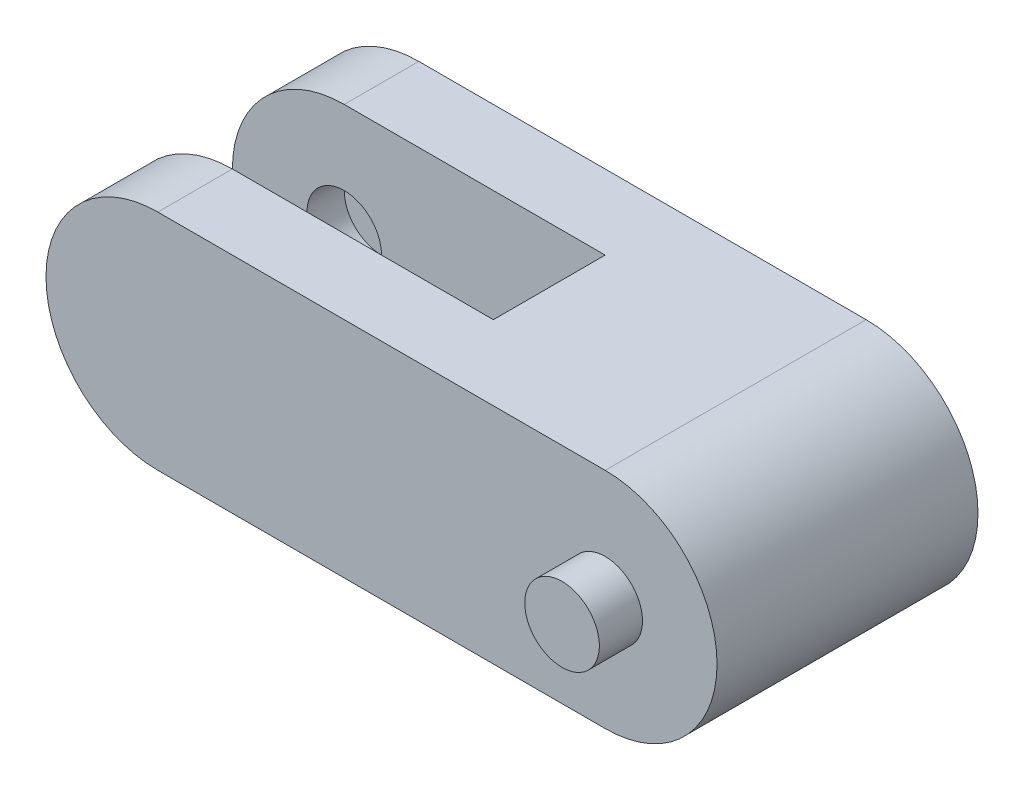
from build123d import *

# Parameters (mm, degrees)
BOSS_EXTRUDE1_DEPTH = 44.45
SKETCH3_R           = 12.7
BOSS_EXTRUDE2_DEPTH = 14.7
CUT_EXTRUDE1_DEPTH  = 19.05
SKETCH7_R           = 12.7
CUT_EXTRUDE2_DEPTH  = 12.7


with BuildPart() as part:
    # Sketch2 → Boss-Extrude1 (new, symmetric)
    with BuildSketch(Plane.XY):
        with BuildLine():
            Line((-76.2, 38.1), (76.2, 38.1))
            ThreePointArc((76.2, 38.1), (114.3, 0), (76.2, -38.1))
            Line((76.2, -38.1), (-76.2, -38.1))
            ThreePointArc((-76.2, -38.1), (-114.3, 0), (-76.2, 38.1))
        make_face()
    extrude(amount=BOSS_EXTRUDE1_DEPTH, both=True)

    # Sketch3 → Boss-Extrude2 (add)
    with BuildSketch(Plane(origin=(0, 0, -44.45), x_dir=(-1, 0, 0), z_dir=(0, 0, -1))):
        with Locations(Location((-76.2, 0, 0), (0, 0, 180))):
            Circle(SKETCH3_R)
    boss_extrude2 = extrude(amount=BOSS_EXTRUDE2_DEPTH)

    # Mirror1: Boss-Extrude2 across plane
    add(boss_extrude2.mirror(Plane.XY))

    # Sketch5 → Cut-Extrude1 (cut, symmetric)
    with BuildSketch(Plane.XY):
        with BuildLine():
            Line((-76.2, 38.1), (12.7, 38.1))
            Line((12.7, 38.1), (12.7, -38.1))
            Line((12.7, -38.1), (-76.2, -38.1))
            ThreePointArc((-76.2, -38.1), (-114.3, 0), (-76.2, 38.1))
        make_face()
    extrude(amount=CUT_EXTRUDE1_DEPTH, both=True, mode=Mode.SUBTRACT)

    # Sketch7 → Cut-Extrude2 (cut)
    with BuildSketch(Plane.XY.offset(-19.05)):
        with Locations((-76.2, 0)):
            Circle(SKETCH7_R)
    cut_extrude2 = extrude(amount=-CUT_EXTRUDE2_DEPTH, mode=Mode.SUBTRACT)

    # Mirror2: Cut-Extrude2 across plane
    add(cut_extrude2.mirror(Plane.XY), mode=Mode.SUBTRACT)


solid = part.part
